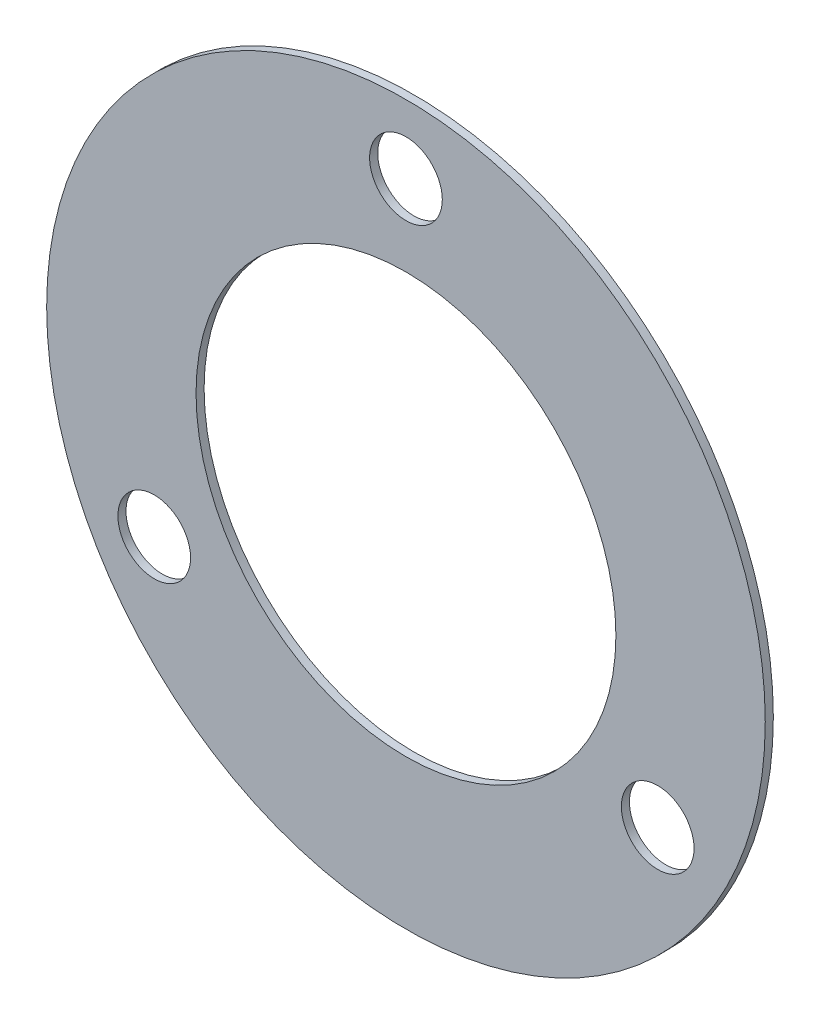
ISO-10303-21;
HEADER;
FILE_DESCRIPTION(('STEP AP214'),'2;1');
FILE_NAME('part.step','',(''),(''),'','','');
FILE_SCHEMA(('AUTOMOTIVE_DESIGN { 1 0 10303 214 1 1 1 1 }'));
ENDSEC;
DATA;
#1=APPLICATION_CONTEXT('core data for automotive mechanical design processes');
#2=APPLICATION_PROTOCOL_DEFINITION('international standard','automotive_design',2000,#1);
#3=PRODUCT_CONTEXT('',#1,'mechanical');
#4=PRODUCT('Part','Part','',(#3));
#5=PRODUCT_RELATED_PRODUCT_CATEGORY('part','',(#4));
#6=PRODUCT_DEFINITION_FORMATION('','',#4);
#7=PRODUCT_DEFINITION_CONTEXT('part definition',#1,'design');
#8=PRODUCT_DEFINITION('design','',#6,#7);
#9=PRODUCT_DEFINITION_SHAPE('','',#8);
#10=(LENGTH_UNIT() NAMED_UNIT(*) SI_UNIT(.MILLI.,.METRE.));
#11=(NAMED_UNIT(*) PLANE_ANGLE_UNIT() SI_UNIT($,.RADIAN.));
#12=(NAMED_UNIT(*) SI_UNIT($,.STERADIAN.) SOLID_ANGLE_UNIT());
#13=UNCERTAINTY_MEASURE_WITH_UNIT(LENGTH_MEASURE(1.E-05),#10,'distance_accuracy_value','');
#14=(GEOMETRIC_REPRESENTATION_CONTEXT(3) GLOBAL_UNCERTAINTY_ASSIGNED_CONTEXT((#13)) GLOBAL_UNIT_ASSIGNED_CONTEXT((#10,
#11,#12)) REPRESENTATION_CONTEXT('',''));
#15=CARTESIAN_POINT('',(0.,0.,0.));
#16=DIRECTION('',(0.,0.,1.));
#17=DIRECTION('',(1.,0.,0.));
#18=AXIS2_PLACEMENT_3D('',#15,#16,#17);
#19=CARTESIAN_POINT('',(0.,0.,0.99999999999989));
#20=DIRECTION('',(0.,0.,1.));
#21=DIRECTION('',(1.,0.,0.));
#22=AXIS2_PLACEMENT_3D('',#19,#20,#21);
#23=PLANE('',#22);
#24=CARTESIAN_POINT('',(-31.1769145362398,-18.,1.00000000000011));
#25=DIRECTION('',(0.,0.,1.));
#26=DIRECTION('',(1.,0.,0.));
#27=AXIS2_PLACEMENT_3D('',#24,#25,#26);
#28=CIRCLE('',#27,4.5);
#29=CARTESIAN_POINT('',(-26.6769145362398,-18.,1.00000000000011));
#30=VERTEX_POINT('',#29);
#31=EDGE_CURVE('E41',#30,#30,#28,.T.);
#32=ORIENTED_EDGE('',*,*,#31,.F.);
#33=EDGE_LOOP('',(#32));
#34=FACE_BOUND('',#33,.T.);
#35=CARTESIAN_POINT('',(0.,0.,0.99999999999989));
#36=DIRECTION('',(0.,0.,1.));
#37=DIRECTION('',(1.,0.,0.));
#38=AXIS2_PLACEMENT_3D('',#35,#36,#37);
#39=CIRCLE('',#38,26.);
#40=CARTESIAN_POINT('',(26.,0.,0.99999999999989));
#41=VERTEX_POINT('',#40);
#42=EDGE_CURVE('E26',#41,#41,#39,.T.);
#43=ORIENTED_EDGE('',*,*,#42,.F.);
#44=EDGE_LOOP('',(#43));
#45=FACE_BOUND('',#44,.T.);
#46=CARTESIAN_POINT('',(0.,0.,0.99999999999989));
#47=DIRECTION('',(0.,0.,1.));
#48=DIRECTION('',(1.,0.,0.));
#49=AXIS2_PLACEMENT_3D('',#46,#47,#48);
#50=CIRCLE('',#49,44.5);
#51=CARTESIAN_POINT('',(44.5,0.,0.99999999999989));
#52=VERTEX_POINT('',#51);
#53=EDGE_CURVE('E10',#52,#52,#50,.T.);
#54=ORIENTED_EDGE('',*,*,#53,.T.);
#55=EDGE_LOOP('',(#54));
#56=FACE_BOUND('',#55,.T.);
#57=CARTESIAN_POINT('',(3.33066907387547E-13,36.,1.00000000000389));
#58=DIRECTION('',(0.,0.,1.));
#59=DIRECTION('',(1.,0.,0.));
#60=AXIS2_PLACEMENT_3D('',#57,#58,#59);
#61=CIRCLE('',#60,4.5);
#62=CARTESIAN_POINT('',(4.50000000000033,36.,1.00000000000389));
#63=VERTEX_POINT('',#62);
#64=EDGE_CURVE('E35',#63,#63,#61,.T.);
#65=ORIENTED_EDGE('',*,*,#64,.F.);
#66=EDGE_LOOP('',(#65));
#67=FACE_BOUND('',#66,.T.);
#68=CARTESIAN_POINT('',(31.1769145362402,-17.9999999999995,0.999999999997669));
#69=DIRECTION('',(0.,0.,1.));
#70=DIRECTION('',(1.,0.,0.));
#71=AXIS2_PLACEMENT_3D('',#68,#69,#70);
#72=CIRCLE('',#71,4.5);
#73=CARTESIAN_POINT('',(35.6769145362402,-17.9999999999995,0.999999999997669));
#74=VERTEX_POINT('',#73);
#75=EDGE_CURVE('E47',#74,#74,#72,.T.);
#76=ORIENTED_EDGE('',*,*,#75,.F.);
#77=EDGE_LOOP('',(#76));
#78=FACE_BOUND('',#77,.T.);
#79=ADVANCED_FACE('F15',(#34,#45,#56,#67,#78),#23,.T.);
#80=CARTESIAN_POINT('',(0.,0.,0.));
#81=DIRECTION('',(0.,0.,1.));
#82=DIRECTION('',(1.,0.,0.));
#83=AXIS2_PLACEMENT_3D('',#80,#81,#82);
#84=PLANE('',#83);
#85=CARTESIAN_POINT('',(-31.1769145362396,-17.9999999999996,0.));
#86=DIRECTION('',(0.,0.,1.));
#87=DIRECTION('',(1.,0.,0.));
#88=AXIS2_PLACEMENT_3D('',#85,#86,#87);
#89=CIRCLE('',#88,4.5);
#90=CARTESIAN_POINT('',(-26.6769145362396,-17.9999999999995,0.));
#91=VERTEX_POINT('',#90);
#92=EDGE_CURVE('E44',#91,#91,#89,.T.);
#93=ORIENTED_EDGE('',*,*,#92,.T.);
#94=EDGE_LOOP('',(#93));
#95=FACE_BOUND('',#94,.T.);
#96=CARTESIAN_POINT('',(0.,0.,0.));
#97=DIRECTION('',(0.,0.,1.));
#98=DIRECTION('',(1.,0.,0.));
#99=AXIS2_PLACEMENT_3D('',#96,#97,#98);
#100=CIRCLE('',#99,26.);
#101=CARTESIAN_POINT('',(26.,0.,0.));
#102=VERTEX_POINT('',#101);
#103=EDGE_CURVE('E30',#102,#102,#100,.T.);
#104=ORIENTED_EDGE('',*,*,#103,.T.);
#105=EDGE_LOOP('',(#104));
#106=FACE_BOUND('',#105,.T.);
#107=CARTESIAN_POINT('',(0.,0.,0.));
#108=DIRECTION('',(0.,0.,1.));
#109=DIRECTION('',(1.,0.,0.));
#110=AXIS2_PLACEMENT_3D('',#107,#108,#109);
#111=CIRCLE('',#110,44.5);
#112=CARTESIAN_POINT('',(44.5,0.,0.));
#113=VERTEX_POINT('',#112);
#114=EDGE_CURVE('E22',#113,#113,#111,.T.);
#115=ORIENTED_EDGE('',*,*,#114,.F.);
#116=EDGE_LOOP('',(#115));
#117=FACE_BOUND('',#116,.T.);
#118=CARTESIAN_POINT('',(3.33066907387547E-13,36.,3.77475828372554E-12));
#119=DIRECTION('',(0.,0.,1.));
#120=DIRECTION('',(1.,0.,0.));
#121=AXIS2_PLACEMENT_3D('',#118,#119,#120);
#122=CIRCLE('',#121,4.5);
#123=CARTESIAN_POINT('',(4.50000000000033,36.,3.77475828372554E-12));
#124=VERTEX_POINT('',#123);
#125=EDGE_CURVE('E38',#124,#124,#122,.T.);
#126=ORIENTED_EDGE('',*,*,#125,.T.);
#127=EDGE_LOOP('',(#126));
#128=FACE_BOUND('',#127,.T.);
#129=CARTESIAN_POINT('',(31.1769145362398,-17.9999999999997,-2.22044604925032E-12));
#130=DIRECTION('',(0.,0.,1.));
#131=DIRECTION('',(1.,0.,0.));
#132=AXIS2_PLACEMENT_3D('',#129,#130,#131);
#133=CIRCLE('',#132,4.5);
#134=CARTESIAN_POINT('',(35.6769145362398,-17.9999999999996,-2.22044604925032E-12));
#135=VERTEX_POINT('',#134);
#136=EDGE_CURVE('E50',#135,#135,#133,.T.);
#137=ORIENTED_EDGE('',*,*,#136,.T.);
#138=EDGE_LOOP('',(#137));
#139=FACE_BOUND('',#138,.T.);
#140=ADVANCED_FACE('F54',(#95,#106,#117,#128,#139),#84,.F.);
#141=CARTESIAN_POINT('',(0.,0.,0.99999999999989));
#142=DIRECTION('',(0.,0.,-1.));
#143=DIRECTION('',(-1.,0.,0.));
#144=AXIS2_PLACEMENT_3D('',#141,#142,#143);
#145=CYLINDRICAL_SURFACE('',#144,44.5);
#146=ORIENTED_EDGE('',*,*,#53,.F.);
#147=EDGE_LOOP('',(#146));
#148=FACE_BOUND('',#147,.T.);
#149=ORIENTED_EDGE('',*,*,#114,.T.);
#150=EDGE_LOOP('',(#149));
#151=FACE_BOUND('',#150,.T.);
#152=ADVANCED_FACE('F17',(#148,#151),#145,.T.);
#153=CARTESIAN_POINT('',(0.,0.,0.99999999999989));
#154=DIRECTION('',(0.,0.,-1.));
#155=DIRECTION('',(-1.,0.,0.));
#156=AXIS2_PLACEMENT_3D('',#153,#154,#155);
#157=CYLINDRICAL_SURFACE('',#156,26.);
#158=ORIENTED_EDGE('',*,*,#42,.T.);
#159=EDGE_LOOP('',(#158));
#160=FACE_BOUND('',#159,.T.);
#161=ORIENTED_EDGE('',*,*,#103,.F.);
#162=EDGE_LOOP('',(#161));
#163=FACE_BOUND('',#162,.T.);
#164=ADVANCED_FACE('F80',(#160,#163),#157,.F.);
#165=CARTESIAN_POINT('',(3.33066907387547E-13,36.,1.00000000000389));
#166=DIRECTION('',(0.,0.,-1.));
#167=DIRECTION('',(-1.,0.,0.));
#168=AXIS2_PLACEMENT_3D('',#165,#166,#167);
#169=CYLINDRICAL_SURFACE('',#168,4.5);
#170=ORIENTED_EDGE('',*,*,#64,.T.);
#171=EDGE_LOOP('',(#170));
#172=FACE_BOUND('',#171,.T.);
#173=ORIENTED_EDGE('',*,*,#125,.F.);
#174=EDGE_LOOP('',(#173));
#175=FACE_BOUND('',#174,.T.);
#176=ADVANCED_FACE('F66',(#172,#175),#169,.F.);
#177=CARTESIAN_POINT('',(-31.1769145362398,-18.,1.00000000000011));
#178=DIRECTION('',(0.,0.,-1.));
#179=DIRECTION('',(-1.,0.,0.));
#180=AXIS2_PLACEMENT_3D('',#177,#178,#179);
#181=CYLINDRICAL_SURFACE('',#180,4.5);
#182=ORIENTED_EDGE('',*,*,#31,.T.);
#183=EDGE_LOOP('',(#182));
#184=FACE_BOUND('',#183,.T.);
#185=ORIENTED_EDGE('',*,*,#92,.F.);
#186=EDGE_LOOP('',(#185));
#187=FACE_BOUND('',#186,.T.);
#188=ADVANCED_FACE('F58',(#184,#187),#181,.F.);
#189=CARTESIAN_POINT('',(31.1769145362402,-17.9999999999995,0.999999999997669));
#190=DIRECTION('',(0.,0.,-1.));
#191=DIRECTION('',(-1.,0.,0.));
#192=AXIS2_PLACEMENT_3D('',#189,#190,#191);
#193=CYLINDRICAL_SURFACE('',#192,4.5);
#194=ORIENTED_EDGE('',*,*,#75,.T.);
#195=EDGE_LOOP('',(#194));
#196=FACE_BOUND('',#195,.T.);
#197=ORIENTED_EDGE('',*,*,#136,.F.);
#198=EDGE_LOOP('',(#197));
#199=FACE_BOUND('',#198,.T.);
#200=ADVANCED_FACE('F56',(#196,#199),#193,.F.);
#201=CLOSED_SHELL('',(#79,#140,#152,#164,#176,#188,#200));
#202=MANIFOLD_SOLID_BREP('B1',#201);
#203=ADVANCED_BREP_SHAPE_REPRESENTATION('',(#18,#202),#14);
#204=SHAPE_DEFINITION_REPRESENTATION(#9,#203);
ENDSEC;
END-ISO-10303-21;
